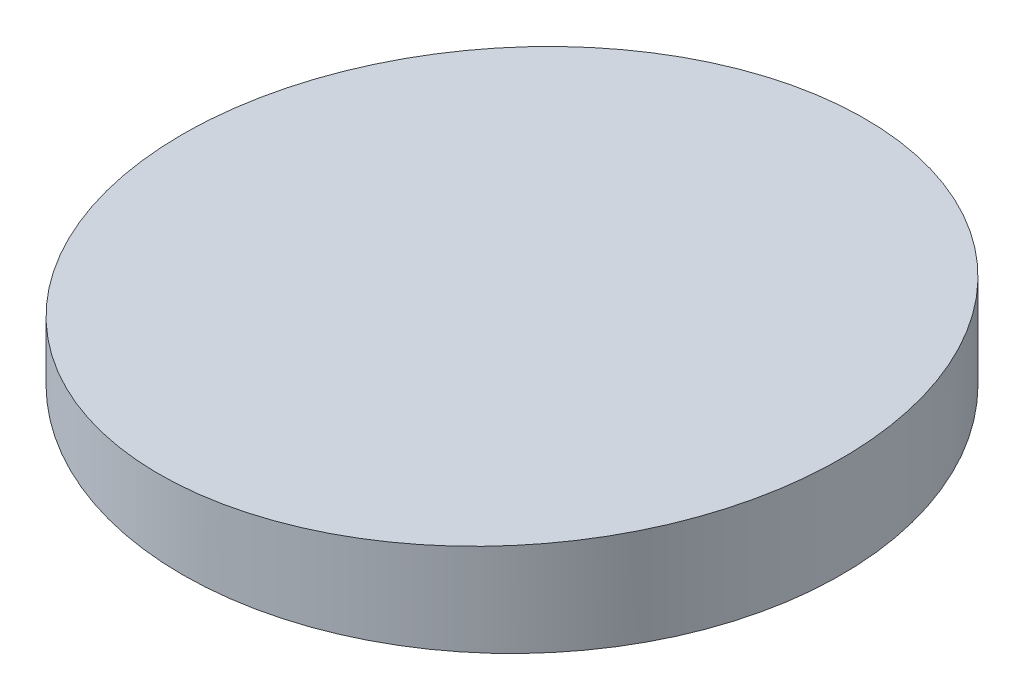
from build123d import *

# Parameters (mm, degrees)
SKETCH1_R           = 50.8
EXTRUDE1_DEPTH      = 15.5194
EXTRUDE2_DEPTH      = 74.499195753
EXTRUDE2_DEPTH_BACK = 74.499195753


with BuildPart() as part:
    # Sketch1 → Extrude1 (new body)
    with BuildSketch(Plane(origin=(0, 0, 0), x_dir=(1, 0, 0), z_dir=(0, 1, 0))):
        with Locations(Location((0, 0, 0), (0, 0, 270))):
            Circle(SKETCH1_R)
    extrude(amount=EXTRUDE1_DEPTH)

    # Sketch2 → Extrude2 (cut, two sides: drawn at the far end of the back side and taken through both)
    with BuildSketch(Plane.XY.offset(-EXTRUDE2_DEPTH_BACK)):
        Polygon((265.769740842, 31.418960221), (50.8, 15.5194), (-50.8, 8.004875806), (-265.769740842, -7.894684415), (-297.568861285, 422.04479727), (233.9706204, 461.358441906), align=None)
    extrude(amount=EXTRUDE2_DEPTH + EXTRUDE2_DEPTH_BACK, mode=Mode.SUBTRACT)


solid = part.part
